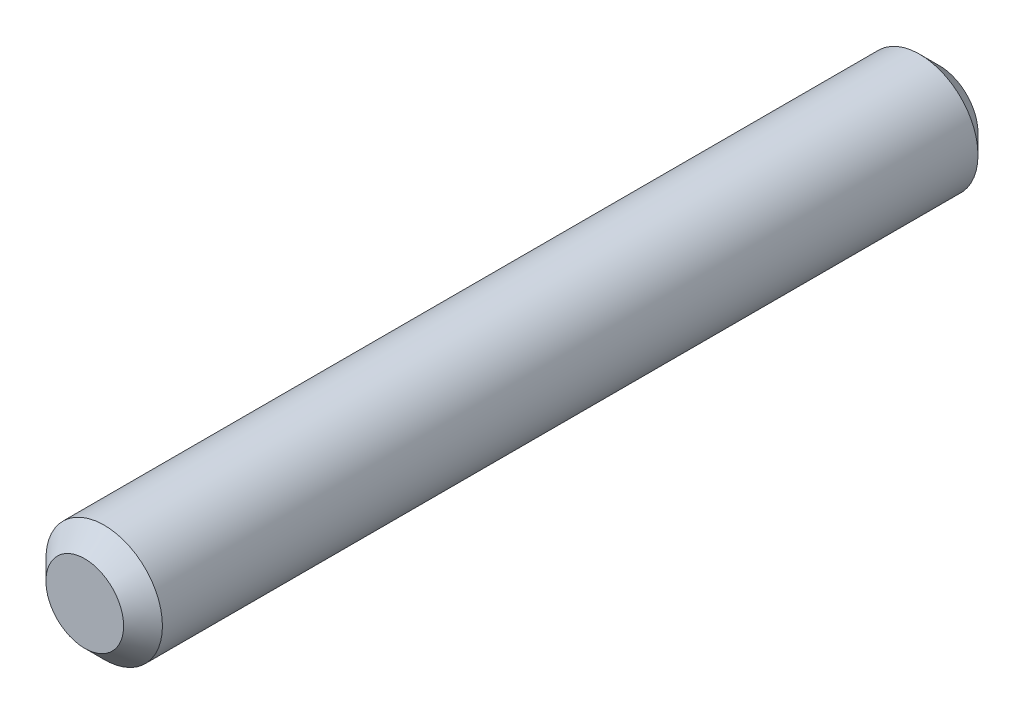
from build123d import *

# Parameters (mm, degrees)
SKETCH_1_R      = 0.75
EXTRUDE_1_DEPTH = 5.5
CHAMFER_1_SIZE  = 0.25


with BuildPart() as part:
    # Sketch 1 → Extrude 1 (new, symmetric)
    with BuildSketch(Plane.XY):
        Circle(SKETCH_1_R)
    extrude(amount=EXTRUDE_1_DEPTH, both=True)

    # Chamfer 1
    chamfer_1_edges = [part.edges().sort_by_distance(p)[0] for p in [
        (-0.75, 0, -5.5),
        (-0.75, 0, 5.5),
    ]]
    chamfer(chamfer_1_edges, length=CHAMFER_1_SIZE)


solid = part.part
